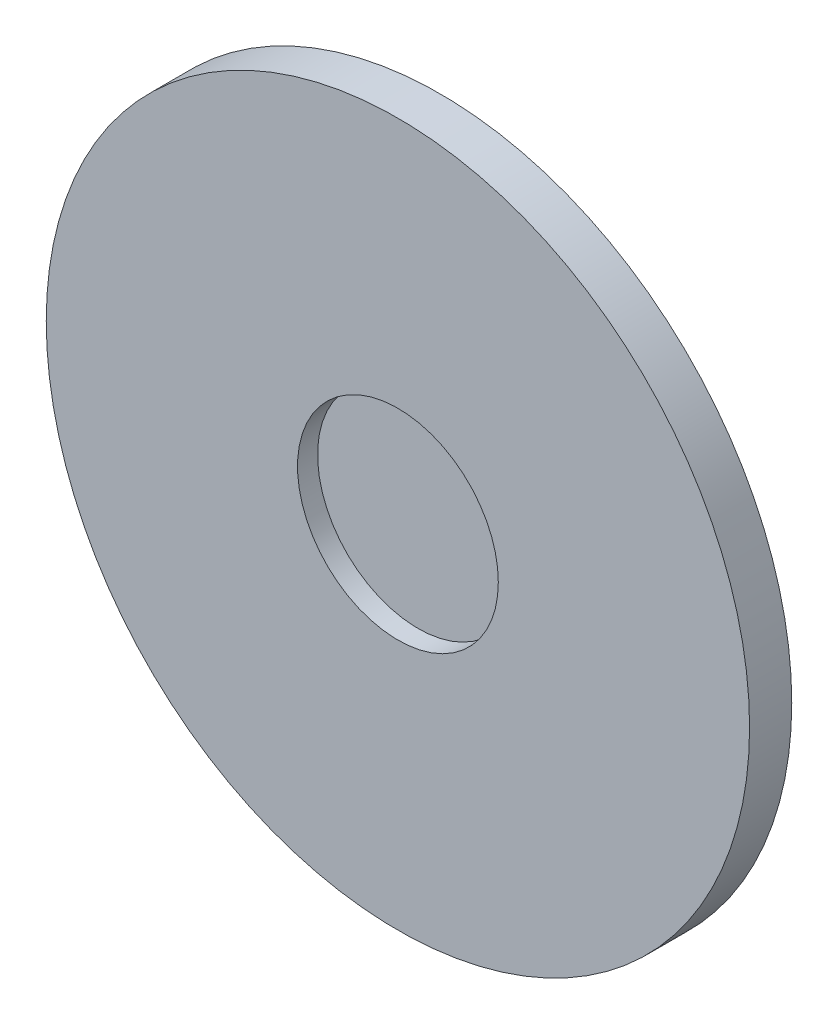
ISO-10303-21;
HEADER;
FILE_DESCRIPTION(('STEP AP214'),'2;1');
FILE_NAME('part.step','',(''),(''),'','','');
FILE_SCHEMA(('AUTOMOTIVE_DESIGN { 1 0 10303 214 1 1 1 1 }'));
ENDSEC;
DATA;
#1=APPLICATION_CONTEXT('core data for automotive mechanical design processes');
#2=APPLICATION_PROTOCOL_DEFINITION('international standard','automotive_design',2000,#1);
#3=PRODUCT_CONTEXT('',#1,'mechanical');
#4=PRODUCT('Part','Part','',(#3));
#5=PRODUCT_RELATED_PRODUCT_CATEGORY('part','',(#4));
#6=PRODUCT_DEFINITION_FORMATION('','',#4);
#7=PRODUCT_DEFINITION_CONTEXT('part definition',#1,'design');
#8=PRODUCT_DEFINITION('design','',#6,#7);
#9=PRODUCT_DEFINITION_SHAPE('','',#8);
#10=(LENGTH_UNIT() NAMED_UNIT(*) SI_UNIT(.MILLI.,.METRE.));
#11=(NAMED_UNIT(*) PLANE_ANGLE_UNIT() SI_UNIT($,.RADIAN.));
#12=(NAMED_UNIT(*) SI_UNIT($,.STERADIAN.) SOLID_ANGLE_UNIT());
#13=UNCERTAINTY_MEASURE_WITH_UNIT(LENGTH_MEASURE(1.E-05),#10,'distance_accuracy_value','');
#14=(GEOMETRIC_REPRESENTATION_CONTEXT(3) GLOBAL_UNCERTAINTY_ASSIGNED_CONTEXT((#13)) GLOBAL_UNIT_ASSIGNED_CONTEXT((#10,
#11,#12)) REPRESENTATION_CONTEXT('',''));
#15=CARTESIAN_POINT('',(0.,0.,0.));
#16=DIRECTION('',(0.,0.,1.));
#17=DIRECTION('',(1.,0.,0.));
#18=AXIS2_PLACEMENT_3D('',#15,#16,#17);
#19=CARTESIAN_POINT('',(0.,0.,5.33399999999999));
#20=DIRECTION('',(0.,0.,-1.));
#21=DIRECTION('',(-1.,0.,0.));
#22=AXIS2_PLACEMENT_3D('',#19,#20,#21);
#23=CYLINDRICAL_SURFACE('',#22,44.4860712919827);
#24=CARTESIAN_POINT('',(0.,0.,5.33399999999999));
#25=DIRECTION('',(0.,0.,1.));
#26=DIRECTION('',(1.,0.,0.));
#27=AXIS2_PLACEMENT_3D('',#24,#25,#26);
#28=CIRCLE('',#27,44.4860712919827);
#29=CARTESIAN_POINT('',(44.4860712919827,0.,5.33399999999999));
#30=VERTEX_POINT('',#29);
#31=EDGE_CURVE('E10',#30,#30,#28,.T.);
#32=ORIENTED_EDGE('',*,*,#31,.F.);
#33=EDGE_LOOP('',(#32));
#34=FACE_BOUND('',#33,.T.);
#35=CARTESIAN_POINT('',(0.,0.,0.));
#36=DIRECTION('',(0.,0.,1.));
#37=DIRECTION('',(1.,0.,0.));
#38=AXIS2_PLACEMENT_3D('',#35,#36,#37);
#39=CIRCLE('',#38,44.4860712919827);
#40=CARTESIAN_POINT('',(44.4860712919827,0.,0.));
#41=VERTEX_POINT('',#40);
#42=EDGE_CURVE('E32',#41,#41,#39,.T.);
#43=ORIENTED_EDGE('',*,*,#42,.T.);
#44=EDGE_LOOP('',(#43));
#45=FACE_BOUND('',#44,.T.);
#46=ADVANCED_FACE('F29',(#34,#45),#23,.T.);
#47=CARTESIAN_POINT('',(0.,0.,5.33399999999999));
#48=DIRECTION('',(0.,0.,1.));
#49=DIRECTION('',(1.,0.,0.));
#50=AXIS2_PLACEMENT_3D('',#47,#48,#49);
#51=PLANE('',#50);
#52=CARTESIAN_POINT('',(0.,0.,5.33399999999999));
#53=DIRECTION('',(0.,0.,1.));
#54=DIRECTION('',(1.,0.,0.));
#55=AXIS2_PLACEMENT_3D('',#52,#53,#54);
#56=CIRCLE('',#55,12.7);
#57=CARTESIAN_POINT('',(12.7,0.,5.33399999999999));
#58=VERTEX_POINT('',#57);
#59=EDGE_CURVE('E41',#58,#58,#56,.T.);
#60=ORIENTED_EDGE('',*,*,#59,.F.);
#61=EDGE_LOOP('',(#60));
#62=FACE_BOUND('',#61,.T.);
#63=ORIENTED_EDGE('',*,*,#31,.T.);
#64=EDGE_LOOP('',(#63));
#65=FACE_BOUND('',#64,.T.);
#66=ADVANCED_FACE('F56',(#62,#65),#51,.T.);
#67=CARTESIAN_POINT('',(0.,0.,0.));
#68=DIRECTION('',(0.,0.,1.));
#69=DIRECTION('',(1.,0.,0.));
#70=AXIS2_PLACEMENT_3D('',#67,#68,#69);
#71=PLANE('',#70);
#72=ORIENTED_EDGE('',*,*,#42,.F.);
#73=EDGE_LOOP('',(#72));
#74=FACE_BOUND('',#73,.T.);
#75=ADVANCED_FACE('F52',(#74),#71,.F.);
#76=CARTESIAN_POINT('',(0.,0.,2.79399999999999));
#77=DIRECTION('',(0.,0.,1.));
#78=DIRECTION('',(1.,0.,0.));
#79=AXIS2_PLACEMENT_3D('',#76,#77,#78);
#80=CYLINDRICAL_SURFACE('',#79,12.7);
#81=CARTESIAN_POINT('',(0.,0.,2.79399999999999));
#82=DIRECTION('',(0.,0.,1.));
#83=DIRECTION('',(1.,0.,0.));
#84=AXIS2_PLACEMENT_3D('',#81,#82,#83);
#85=CIRCLE('',#84,12.7);
#86=CARTESIAN_POINT('',(12.7,0.,2.79399999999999));
#87=VERTEX_POINT('',#86);
#88=EDGE_CURVE('E39',#87,#87,#85,.T.);
#89=ORIENTED_EDGE('',*,*,#88,.F.);
#90=EDGE_LOOP('',(#89));
#91=FACE_BOUND('',#90,.T.);
#92=ORIENTED_EDGE('',*,*,#59,.T.);
#93=EDGE_LOOP('',(#92));
#94=FACE_BOUND('',#93,.T.);
#95=ADVANCED_FACE('F49',(#91,#94),#80,.F.);
#96=CARTESIAN_POINT('',(0.,0.,2.79399999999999));
#97=DIRECTION('',(0.,0.,1.));
#98=DIRECTION('',(1.,0.,0.));
#99=AXIS2_PLACEMENT_3D('',#96,#97,#98);
#100=PLANE('',#99);
#101=ORIENTED_EDGE('',*,*,#88,.T.);
#102=EDGE_LOOP('',(#101));
#103=FACE_BOUND('',#102,.T.);
#104=ADVANCED_FACE('F47',(#103),#100,.T.);
#105=CLOSED_SHELL('',(#46,#66,#75,#95,#104));
#106=MANIFOLD_SOLID_BREP('B2',#105);
#107=ADVANCED_BREP_SHAPE_REPRESENTATION('',(#18,#106),#14);
#108=SHAPE_DEFINITION_REPRESENTATION(#9,#107);
ENDSEC;
END-ISO-10303-21;
